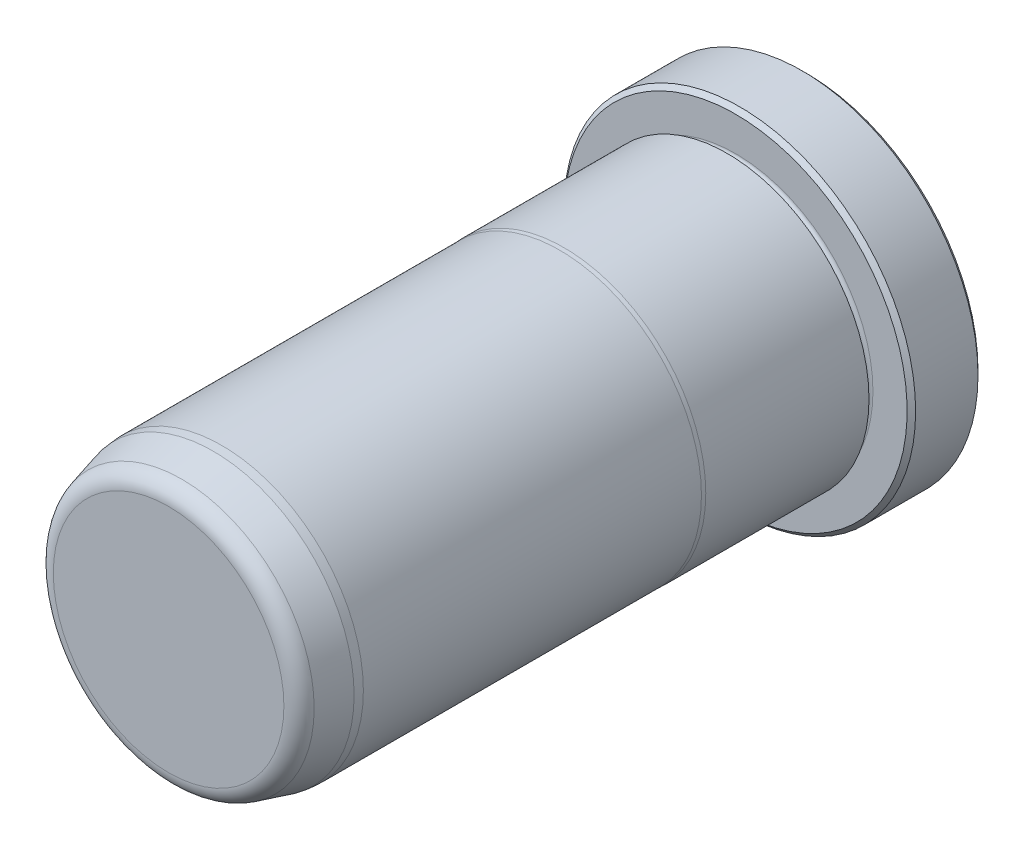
ISO-10303-21;
HEADER;
FILE_DESCRIPTION(('STEP AP214'),'2;1');
FILE_NAME('part.step','',(''),(''),'','','');
FILE_SCHEMA(('AUTOMOTIVE_DESIGN { 1 0 10303 214 1 1 1 1 }'));
ENDSEC;
DATA;
#1=APPLICATION_CONTEXT('core data for automotive mechanical design processes');
#2=APPLICATION_PROTOCOL_DEFINITION('international standard','automotive_design',2000,#1);
#3=PRODUCT_CONTEXT('',#1,'mechanical');
#4=PRODUCT('Part','Part','',(#3));
#5=PRODUCT_RELATED_PRODUCT_CATEGORY('part','',(#4));
#6=PRODUCT_DEFINITION_FORMATION('','',#4);
#7=PRODUCT_DEFINITION_CONTEXT('part definition',#1,'design');
#8=PRODUCT_DEFINITION('design','',#6,#7);
#9=PRODUCT_DEFINITION_SHAPE('','',#8);
#10=(LENGTH_UNIT() NAMED_UNIT(*) SI_UNIT(.MILLI.,.METRE.));
#11=(NAMED_UNIT(*) PLANE_ANGLE_UNIT() SI_UNIT($,.RADIAN.));
#12=(NAMED_UNIT(*) SI_UNIT($,.STERADIAN.) SOLID_ANGLE_UNIT());
#13=UNCERTAINTY_MEASURE_WITH_UNIT(LENGTH_MEASURE(1.E-05),#10,'distance_accuracy_value','');
#14=(GEOMETRIC_REPRESENTATION_CONTEXT(3) GLOBAL_UNCERTAINTY_ASSIGNED_CONTEXT((#13)) GLOBAL_UNIT_ASSIGNED_CONTEXT((#10,
#11,#12)) REPRESENTATION_CONTEXT('',''));
#15=CARTESIAN_POINT('',(0.,0.,0.));
#16=DIRECTION('',(0.,0.,1.));
#17=DIRECTION('',(1.,0.,0.));
#18=AXIS2_PLACEMENT_3D('',#15,#16,#17);
#19=CARTESIAN_POINT('',(0.,0.,0.));
#20=DIRECTION('',(0.,0.,1.));
#21=DIRECTION('',(1.,0.,0.));
#22=AXIS2_PLACEMENT_3D('',#19,#20,#21);
#23=PLANE('',#22);
#24=CARTESIAN_POINT('',(0.,0.,0.));
#25=DIRECTION('',(0.,0.,1.));
#26=DIRECTION('',(1.,0.,0.));
#27=AXIS2_PLACEMENT_3D('',#24,#25,#26);
#28=CIRCLE('',#27,15.367);
#29=CARTESIAN_POINT('',(15.367,0.,0.));
#30=VERTEX_POINT('',#29);
#31=EDGE_CURVE('E37',#30,#30,#28,.F.);
#32=ORIENTED_EDGE('',*,*,#31,.T.);
#33=EDGE_LOOP('',(#32));
#34=FACE_BOUND('',#33,.T.);
#35=ADVANCED_FACE('F30',(#34),#23,.F.);
#36=CARTESIAN_POINT('',(0.,0.,0.));
#37=DIRECTION('',(0.,0.,1.));
#38=DIRECTION('',(1.,0.,0.));
#39=AXIS2_PLACEMENT_3D('',#36,#37,#38);
#40=CYLINDRICAL_SURFACE('',#39,15.748);
#41=CARTESIAN_POINT('',(0.,0.,0.380999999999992));
#42=DIRECTION('',(0.,0.,1.));
#43=DIRECTION('',(1.,0.,0.));
#44=AXIS2_PLACEMENT_3D('',#41,#42,#43);
#45=CIRCLE('',#44,15.748);
#46=CARTESIAN_POINT('',(15.748,0.,0.380999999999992));
#47=VERTEX_POINT('',#46);
#48=EDGE_CURVE('E41',#47,#47,#45,.T.);
#49=ORIENTED_EDGE('',*,*,#48,.T.);
#50=EDGE_LOOP('',(#49));
#51=FACE_BOUND('',#50,.T.);
#52=CARTESIAN_POINT('',(0.,0.,5.96900000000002));
#53=DIRECTION('',(0.,0.,-1.));
#54=DIRECTION('',(-1.,0.,0.));
#55=AXIS2_PLACEMENT_3D('',#52,#53,#54);
#56=CIRCLE('',#55,15.748);
#57=CARTESIAN_POINT('',(-15.748,0.,5.96900000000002));
#58=VERTEX_POINT('',#57);
#59=EDGE_CURVE('E45',#58,#58,#56,.T.);
#60=ORIENTED_EDGE('',*,*,#59,.T.);
#61=EDGE_LOOP('',(#60));
#62=FACE_BOUND('',#61,.T.);
#63=ADVANCED_FACE('F118',(#51,#62),#40,.T.);
#64=CARTESIAN_POINT('',(0.,15.748,6.35));
#65=DIRECTION('',(0.,0.,-1.));
#66=DIRECTION('',(-1.,0.,0.));
#67=AXIS2_PLACEMENT_3D('',#64,#65,#66);
#68=PLANE('',#67);
#69=CARTESIAN_POINT('',(0.,0.,6.35));
#70=DIRECTION('',(0.,0.,-1.));
#71=DIRECTION('',(-1.,0.,0.));
#72=AXIS2_PLACEMENT_3D('',#69,#70,#71);
#73=CIRCLE('',#72,15.367);
#74=CARTESIAN_POINT('',(-15.367,0.,6.35));
#75=VERTEX_POINT('',#74);
#76=EDGE_CURVE('E10',#75,#75,#73,.F.);
#77=ORIENTED_EDGE('',*,*,#76,.T.);
#78=EDGE_LOOP('',(#77));
#79=FACE_BOUND('',#78,.T.);
#80=CARTESIAN_POINT('',(0.,0.,6.35));
#81=DIRECTION('',(0.,0.,1.));
#82=DIRECTION('',(1.,0.,0.));
#83=AXIS2_PLACEMENT_3D('',#80,#81,#82);
#84=CIRCLE('',#83,12.3063);
#85=CARTESIAN_POINT('',(12.3063,0.,6.35));
#86=VERTEX_POINT('',#85);
#87=EDGE_CURVE('E56',#86,#86,#84,.T.);
#88=ORIENTED_EDGE('',*,*,#87,.F.);
#89=EDGE_LOOP('',(#88));
#90=FACE_BOUND('',#89,.T.);
#91=ADVANCED_FACE('F113',(#79,#90),#68,.F.);
#92=CARTESIAN_POINT('',(0.,0.,6.731));
#93=DIRECTION('',(0.,0.,1.));
#94=DIRECTION('',(1.,0.,0.));
#95=AXIS2_PLACEMENT_3D('',#92,#93,#94);
#96=TOROIDAL_SURFACE('',#95,12.3063,0.381);
#97=CARTESIAN_POINT('',(0.,0.,7.112));
#98=DIRECTION('',(0.,0.,1.));
#99=DIRECTION('',(1.,0.,0.));
#100=AXIS2_PLACEMENT_3D('',#97,#98,#99);
#101=CIRCLE('',#100,12.3063);
#102=CARTESIAN_POINT('',(12.3063,0.,7.112));
#103=VERTEX_POINT('',#102);
#104=EDGE_CURVE('E59',#103,#103,#101,.T.);
#105=ORIENTED_EDGE('',*,*,#104,.F.);
#106=EDGE_LOOP('',(#105));
#107=FACE_BOUND('',#106,.T.);
#108=ORIENTED_EDGE('',*,*,#87,.T.);
#109=EDGE_LOOP('',(#108));
#110=FACE_BOUND('',#109,.T.);
#111=ADVANCED_FACE('F107',(#107,#110),#96,.F.);
#112=CARTESIAN_POINT('',(0.,12.3063,7.112));
#113=DIRECTION('',(0.,0.,1.));
#114=DIRECTION('',(1.,0.,0.));
#115=AXIS2_PLACEMENT_3D('',#112,#113,#114);
#116=PLANE('',#115);
#117=CARTESIAN_POINT('',(0.,0.,7.112));
#118=DIRECTION('',(0.,0.,1.));
#119=DIRECTION('',(1.,0.,0.));
#120=AXIS2_PLACEMENT_3D('',#117,#118,#119);
#121=CIRCLE('',#120,12.7127);
#122=CARTESIAN_POINT('',(12.7127,0.,7.112));
#123=VERTEX_POINT('',#122);
#124=EDGE_CURVE('E62',#123,#123,#121,.T.);
#125=ORIENTED_EDGE('',*,*,#124,.F.);
#126=EDGE_LOOP('',(#125));
#127=FACE_BOUND('',#126,.T.);
#128=ORIENTED_EDGE('',*,*,#104,.T.);
#129=EDGE_LOOP('',(#128));
#130=FACE_BOUND('',#129,.T.);
#131=ADVANCED_FACE('F101',(#127,#130),#116,.F.);
#132=CARTESIAN_POINT('',(0.,0.,0.));
#133=DIRECTION('',(0.,0.,1.));
#134=DIRECTION('',(1.,0.,0.));
#135=AXIS2_PLACEMENT_3D('',#132,#133,#134);
#136=CYLINDRICAL_SURFACE('',#135,12.7127);
#137=CARTESIAN_POINT('',(0.,0.,21.7347630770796));
#138=DIRECTION('',(0.,0.,1.));
#139=DIRECTION('',(1.,0.,0.));
#140=AXIS2_PLACEMENT_3D('',#137,#138,#139);
#141=CIRCLE('',#140,12.7127);
#142=CARTESIAN_POINT('',(12.7127,0.,21.7347630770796));
#143=VERTEX_POINT('',#142);
#144=EDGE_CURVE('E65',#143,#143,#141,.T.);
#145=ORIENTED_EDGE('',*,*,#144,.F.);
#146=EDGE_LOOP('',(#145));
#147=FACE_BOUND('',#146,.T.);
#148=ORIENTED_EDGE('',*,*,#124,.T.);
#149=EDGE_LOOP('',(#148));
#150=FACE_BOUND('',#149,.T.);
#151=ADVANCED_FACE('F95',(#147,#150),#136,.T.);
#152=CARTESIAN_POINT('',(0.,0.,21.7347630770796));
#153=DIRECTION('',(0.,0.,-1.));
#154=DIRECTION('',(-1.,0.,0.));
#155=AXIS2_PLACEMENT_3D('',#152,#153,#154);
#156=CONICAL_SURFACE('',#155,12.7127,0.069813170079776);
#157=CARTESIAN_POINT('',(0.,0.,22.098));
#158=DIRECTION('',(0.,0.,1.));
#159=DIRECTION('',(1.,0.,0.));
#160=AXIS2_PLACEMENT_3D('',#157,#158,#159);
#161=CIRCLE('',#160,12.6873);
#162=CARTESIAN_POINT('',(12.6873,0.,22.098));
#163=VERTEX_POINT('',#162);
#164=EDGE_CURVE('E68',#163,#163,#161,.T.);
#165=ORIENTED_EDGE('',*,*,#164,.F.);
#166=EDGE_LOOP('',(#165));
#167=FACE_BOUND('',#166,.T.);
#168=ORIENTED_EDGE('',*,*,#144,.T.);
#169=EDGE_LOOP('',(#168));
#170=FACE_BOUND('',#169,.T.);
#171=ADVANCED_FACE('F89',(#167,#170),#156,.T.);
#172=CARTESIAN_POINT('',(0.,0.,0.));
#173=DIRECTION('',(0.,0.,1.));
#174=DIRECTION('',(1.,0.,0.));
#175=AXIS2_PLACEMENT_3D('',#172,#173,#174);
#176=CYLINDRICAL_SURFACE('',#175,12.6873);
#177=CARTESIAN_POINT('',(0.,0.,52.3875));
#178=DIRECTION('',(0.,0.,1.));
#179=DIRECTION('',(1.,0.,0.));
#180=AXIS2_PLACEMENT_3D('',#177,#178,#179);
#181=CIRCLE('',#180,12.6873);
#182=CARTESIAN_POINT('',(12.6873,0.,52.3875));
#183=VERTEX_POINT('',#182);
#184=EDGE_CURVE('E71',#183,#183,#181,.T.);
#185=ORIENTED_EDGE('',*,*,#184,.F.);
#186=EDGE_LOOP('',(#185));
#187=FACE_BOUND('',#186,.T.);
#188=ORIENTED_EDGE('',*,*,#164,.T.);
#189=EDGE_LOOP('',(#188));
#190=FACE_BOUND('',#189,.T.);
#191=ADVANCED_FACE('F83',(#187,#190),#176,.T.);
#192=CARTESIAN_POINT('',(0.,0.,52.3875));
#193=DIRECTION('',(0.,0.,-1.));
#194=DIRECTION('',(-1.,0.,0.));
#195=AXIS2_PLACEMENT_3D('',#192,#193,#194);
#196=CONICAL_SURFACE('',#195,12.6873,0.0872664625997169);
#197=CARTESIAN_POINT('',(0.,0.,53.1495));
#198=DIRECTION('',(0.,0.,1.));
#199=DIRECTION('',(1.,0.,0.));
#200=AXIS2_PLACEMENT_3D('',#197,#198,#199);
#201=CIRCLE('',#200,12.6206336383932);
#202=CARTESIAN_POINT('',(12.6206336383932,0.,53.1495));
#203=VERTEX_POINT('',#202);
#204=EDGE_CURVE('E74',#203,#203,#201,.T.);
#205=ORIENTED_EDGE('',*,*,#204,.F.);
#206=EDGE_LOOP('',(#205));
#207=FACE_BOUND('',#206,.T.);
#208=ORIENTED_EDGE('',*,*,#184,.T.);
#209=EDGE_LOOP('',(#208));
#210=FACE_BOUND('',#209,.T.);
#211=ADVANCED_FACE('F80',(#207,#210),#196,.T.);
#212=CARTESIAN_POINT('',(0.,0.,53.1495));
#213=DIRECTION('',(0.,0.,-1.));
#214=DIRECTION('',(-1.,0.,0.));
#215=AXIS2_PLACEMENT_3D('',#212,#213,#214);
#216=CONICAL_SURFACE('',#215,12.6206336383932,0.26179938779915);
#217=CARTESIAN_POINT('',(0.,0.,55.9733752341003));
#218=DIRECTION('',(0.,0.,1.));
#219=DIRECTION('',(1.,0.,0.));
#220=AXIS2_PLACEMENT_3D('',#217,#218,#219);
#221=CIRCLE('',#220,11.8639785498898);
#222=CARTESIAN_POINT('',(11.8639785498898,0.,55.9733752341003));
#223=VERTEX_POINT('',#222);
#224=EDGE_CURVE('E50',#223,#223,#221,.F.);
#225=ORIENTED_EDGE('',*,*,#224,.T.);
#226=EDGE_LOOP('',(#225));
#227=FACE_BOUND('',#226,.T.);
#228=ORIENTED_EDGE('',*,*,#204,.T.);
#229=EDGE_LOOP('',(#228));
#230=FACE_BOUND('',#229,.T.);
#231=ADVANCED_FACE('F78',(#227,#230),#216,.T.);
#232=CARTESIAN_POINT('',(0.,11.5487028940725,57.15));
#233=DIRECTION('',(0.,0.,-1.));
#234=DIRECTION('',(-1.,0.,0.));
#235=AXIS2_PLACEMENT_3D('',#232,#233,#234);
#236=PLANE('',#235);
#237=CARTESIAN_POINT('',(0.,0.,57.15));
#238=DIRECTION('',(0.,0.,-1.));
#239=DIRECTION('',(-1.,0.,0.));
#240=AXIS2_PLACEMENT_3D('',#237,#238,#239);
#241=CIRCLE('',#240,10.3305713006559);
#242=CARTESIAN_POINT('',(-10.3305713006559,0.,57.15));
#243=VERTEX_POINT('',#242);
#244=EDGE_CURVE('E53',#243,#243,#241,.F.);
#245=ORIENTED_EDGE('',*,*,#244,.T.);
#246=EDGE_LOOP('',(#245));
#247=FACE_BOUND('',#246,.T.);
#248=ADVANCED_FACE('F133',(#247),#236,.F.);
#249=CARTESIAN_POINT('',(0.,0.,55.5625));
#250=DIRECTION('',(0.,0.,-1.));
#251=DIRECTION('',(-1.,0.,0.));
#252=AXIS2_PLACEMENT_3D('',#249,#250,#251);
#253=TOROIDAL_SURFACE('',#252,10.3305713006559,1.5875);
#254=ORIENTED_EDGE('',*,*,#224,.F.);
#255=EDGE_LOOP('',(#254));
#256=FACE_BOUND('',#255,.T.);
#257=ORIENTED_EDGE('',*,*,#244,.F.);
#258=EDGE_LOOP('',(#257));
#259=FACE_BOUND('',#258,.T.);
#260=ADVANCED_FACE('F130',(#256,#259),#253,.T.);
#261=CARTESIAN_POINT('',(0.,0.,0.380999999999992));
#262=DIRECTION('',(0.,0.,1.));
#263=DIRECTION('',(1.,0.,0.));
#264=AXIS2_PLACEMENT_3D('',#261,#262,#263);
#265=CONICAL_SURFACE('',#264,15.748,0.785398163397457);
#266=ORIENTED_EDGE('',*,*,#31,.F.);
#267=EDGE_LOOP('',(#266));
#268=FACE_BOUND('',#267,.T.);
#269=ORIENTED_EDGE('',*,*,#48,.F.);
#270=EDGE_LOOP('',(#269));
#271=FACE_BOUND('',#270,.T.);
#272=ADVANCED_FACE('F132',(#268,#271),#265,.T.);
#273=CARTESIAN_POINT('',(0.,0.,6.35));
#274=DIRECTION('',(0.,0.,-1.));
#275=DIRECTION('',(-1.,0.,0.));
#276=AXIS2_PLACEMENT_3D('',#273,#274,#275);
#277=CONICAL_SURFACE('',#276,15.367,0.785398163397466);
#278=ORIENTED_EDGE('',*,*,#59,.F.);
#279=EDGE_LOOP('',(#278));
#280=FACE_BOUND('',#279,.T.);
#281=ORIENTED_EDGE('',*,*,#76,.F.);
#282=EDGE_LOOP('',(#281));
#283=FACE_BOUND('',#282,.T.);
#284=ADVANCED_FACE('F32',(#280,#283),#277,.T.);
#285=CLOSED_SHELL('',(#35,#63,#91,#111,#131,#151,#171,#191,#211,#231,#248,#260,#272,#284));
#286=MANIFOLD_SOLID_BREP('B2',#285);
#287=ADVANCED_BREP_SHAPE_REPRESENTATION('',(#18,#286),#14);
#288=SHAPE_DEFINITION_REPRESENTATION(#9,#287);
ENDSEC;
END-ISO-10303-21;
